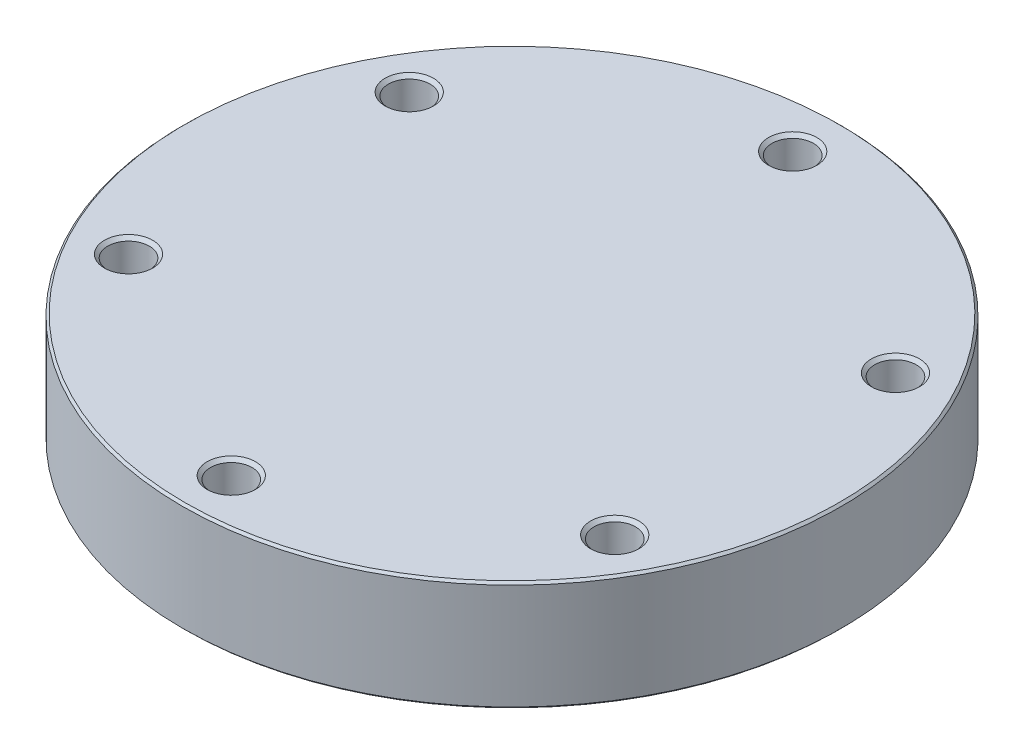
ISO-10303-21;
HEADER;
FILE_DESCRIPTION(('STEP AP214'),'2;1');
FILE_NAME('part.step','',(''),(''),'','','');
FILE_SCHEMA(('AUTOMOTIVE_DESIGN { 1 0 10303 214 1 1 1 1 }'));
ENDSEC;
DATA;
#1=APPLICATION_CONTEXT('core data for automotive mechanical design processes');
#2=APPLICATION_PROTOCOL_DEFINITION('international standard','automotive_design',2000,#1);
#3=PRODUCT_CONTEXT('',#1,'mechanical');
#4=PRODUCT('Part','Part','',(#3));
#5=PRODUCT_RELATED_PRODUCT_CATEGORY('part','',(#4));
#6=PRODUCT_DEFINITION_FORMATION('','',#4);
#7=PRODUCT_DEFINITION_CONTEXT('part definition',#1,'design');
#8=PRODUCT_DEFINITION('design','',#6,#7);
#9=PRODUCT_DEFINITION_SHAPE('','',#8);
#10=(LENGTH_UNIT() NAMED_UNIT(*) SI_UNIT(.MILLI.,.METRE.));
#11=(NAMED_UNIT(*) PLANE_ANGLE_UNIT() SI_UNIT($,.RADIAN.));
#12=(NAMED_UNIT(*) SI_UNIT($,.STERADIAN.) SOLID_ANGLE_UNIT());
#13=UNCERTAINTY_MEASURE_WITH_UNIT(LENGTH_MEASURE(1.E-05),#10,'distance_accuracy_value','');
#14=(GEOMETRIC_REPRESENTATION_CONTEXT(3) GLOBAL_UNCERTAINTY_ASSIGNED_CONTEXT((#13)) GLOBAL_UNIT_ASSIGNED_CONTEXT((#10,
#11,#12)) REPRESENTATION_CONTEXT('',''));
#15=CARTESIAN_POINT('',(0.,0.,0.));
#16=DIRECTION('',(0.,0.,1.));
#17=DIRECTION('',(1.,0.,0.));
#18=AXIS2_PLACEMENT_3D('',#15,#16,#17);
#19=CARTESIAN_POINT('',(0.,12.446,0.));
#20=DIRECTION('',(0.,-1.,0.));
#21=DIRECTION('',(0.,0.,-1.));
#22=AXIS2_PLACEMENT_3D('',#19,#20,#21);
#23=CYLINDRICAL_SURFACE('',#22,37.2745);
#24=CARTESIAN_POINT('',(0.,0.253999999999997,0.));
#25=DIRECTION('',(0.,1.,0.));
#26=DIRECTION('',(0.,0.,1.));
#27=AXIS2_PLACEMENT_3D('',#24,#25,#26);
#28=CIRCLE('',#27,37.2745);
#29=CARTESIAN_POINT('',(0.,0.253999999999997,37.2745));
#30=VERTEX_POINT('',#29);
#31=EDGE_CURVE('E79',#30,#30,#28,.T.);
#32=ORIENTED_EDGE('',*,*,#31,.T.);
#33=EDGE_LOOP('',(#32));
#34=FACE_BOUND('',#33,.T.);
#35=CARTESIAN_POINT('',(0.,12.192,0.));
#36=DIRECTION('',(0.,1.,0.));
#37=DIRECTION('',(0.,0.,1.));
#38=AXIS2_PLACEMENT_3D('',#35,#36,#37);
#39=CIRCLE('',#38,37.2745);
#40=CARTESIAN_POINT('',(0.,12.192,37.2745));
#41=VERTEX_POINT('',#40);
#42=EDGE_CURVE('E82',#41,#41,#39,.F.);
#43=ORIENTED_EDGE('',*,*,#42,.T.);
#44=EDGE_LOOP('',(#43));
#45=FACE_BOUND('',#44,.T.);
#46=ADVANCED_FACE('F40',(#34,#45),#23,.T.);
#47=CARTESIAN_POINT('',(0.,12.446,0.));
#48=DIRECTION('',(0.,1.,0.));
#49=DIRECTION('',(0.,0.,1.));
#50=AXIS2_PLACEMENT_3D('',#47,#48,#49);
#51=PLANE('',#50);
#52=CARTESIAN_POINT('',(0.,12.446,0.));
#53=DIRECTION('',(0.,1.,0.));
#54=DIRECTION('',(0.,0.,1.));
#55=AXIS2_PLACEMENT_3D('',#52,#53,#54);
#56=CIRCLE('',#55,37.0205);
#57=CARTESIAN_POINT('',(0.,12.446,37.0205));
#58=VERTEX_POINT('',#57);
#59=EDGE_CURVE('E73',#58,#58,#56,.T.);
#60=ORIENTED_EDGE('',*,*,#59,.T.);
#61=EDGE_LOOP('',(#60));
#62=FACE_BOUND('',#61,.T.);
#63=CARTESIAN_POINT('',(0.,12.446,-31.75));
#64=DIRECTION('',(0.,1.,0.));
#65=DIRECTION('',(0.,0.,1.));
#66=AXIS2_PLACEMENT_3D('',#63,#64,#65);
#67=CIRCLE('',#66,2.7305);
#68=CARTESIAN_POINT('',(0.,12.446,-29.0195));
#69=VERTEX_POINT('',#68);
#70=EDGE_CURVE('E151',#69,#69,#67,.T.);
#71=ORIENTED_EDGE('',*,*,#70,.F.);
#72=EDGE_LOOP('',(#71));
#73=FACE_BOUND('',#72,.T.);
#74=CARTESIAN_POINT('',(27.4963065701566,12.446,-15.8750000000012));
#75=DIRECTION('',(0.,1.,0.));
#76=DIRECTION('',(0.,0.,1.));
#77=AXIS2_PLACEMENT_3D('',#74,#75,#76);
#78=CIRCLE('',#77,2.7305);
#79=CARTESIAN_POINT('',(27.4963065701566,12.446,-13.1445000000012));
#80=VERTEX_POINT('',#79);
#81=EDGE_CURVE('E139',#80,#80,#78,.T.);
#82=ORIENTED_EDGE('',*,*,#81,.F.);
#83=EDGE_LOOP('',(#82));
#84=FACE_BOUND('',#83,.T.);
#85=CARTESIAN_POINT('',(27.496306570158,12.446,15.8749999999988));
#86=DIRECTION('',(0.,1.,0.));
#87=DIRECTION('',(0.,0.,1.));
#88=AXIS2_PLACEMENT_3D('',#85,#86,#87);
#89=CIRCLE('',#88,2.7305);
#90=CARTESIAN_POINT('',(27.496306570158,12.446,18.6054999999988));
#91=VERTEX_POINT('',#90);
#92=EDGE_CURVE('E127',#91,#91,#89,.T.);
#93=ORIENTED_EDGE('',*,*,#92,.F.);
#94=EDGE_LOOP('',(#93));
#95=FACE_BOUND('',#94,.T.);
#96=CARTESIAN_POINT('',(2.6955030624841E-12,12.446,31.75));
#97=DIRECTION('',(0.,1.,0.));
#98=DIRECTION('',(0.,0.,1.));
#99=AXIS2_PLACEMENT_3D('',#96,#97,#98);
#100=CIRCLE('',#99,2.7305);
#101=CARTESIAN_POINT('',(2.6955030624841E-12,12.446,34.4805));
#102=VERTEX_POINT('',#101);
#103=EDGE_CURVE('E115',#102,#102,#100,.T.);
#104=ORIENTED_EDGE('',*,*,#103,.F.);
#105=EDGE_LOOP('',(#104));
#106=FACE_BOUND('',#105,.T.);
#107=CARTESIAN_POINT('',(-27.4963065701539,12.446,15.8750000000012));
#108=DIRECTION('',(0.,1.,0.));
#109=DIRECTION('',(0.,0.,1.));
#110=AXIS2_PLACEMENT_3D('',#107,#108,#109);
#111=CIRCLE('',#110,2.7305);
#112=CARTESIAN_POINT('',(-27.4963065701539,12.446,18.6055000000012));
#113=VERTEX_POINT('',#112);
#114=EDGE_CURVE('E103',#113,#113,#111,.T.);
#115=ORIENTED_EDGE('',*,*,#114,.F.);
#116=EDGE_LOOP('',(#115));
#117=FACE_BOUND('',#116,.T.);
#118=CARTESIAN_POINT('',(-27.4963065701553,12.446,-15.8749999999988));
#119=DIRECTION('',(0.,1.,0.));
#120=DIRECTION('',(0.,0.,1.));
#121=AXIS2_PLACEMENT_3D('',#118,#119,#120);
#122=CIRCLE('',#121,2.7305);
#123=CARTESIAN_POINT('',(-27.4963065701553,12.446,-13.1444999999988));
#124=VERTEX_POINT('',#123);
#125=EDGE_CURVE('E91',#124,#124,#122,.T.);
#126=ORIENTED_EDGE('',*,*,#125,.F.);
#127=EDGE_LOOP('',(#126));
#128=FACE_BOUND('',#127,.T.);
#129=ADVANCED_FACE('F181',(#62,#73,#84,#95,#106,#117,#128),#51,.T.);
#130=CARTESIAN_POINT('',(0.,0.,0.));
#131=DIRECTION('',(0.,1.,0.));
#132=DIRECTION('',(0.,0.,1.));
#133=AXIS2_PLACEMENT_3D('',#130,#131,#132);
#134=PLANE('',#133);
#135=CARTESIAN_POINT('',(0.,0.,0.));
#136=DIRECTION('',(0.,1.,0.));
#137=DIRECTION('',(0.,0.,1.));
#138=AXIS2_PLACEMENT_3D('',#135,#136,#137);
#139=CIRCLE('',#138,27.8257);
#140=CARTESIAN_POINT('',(0.,0.,27.8257));
#141=VERTEX_POINT('',#140);
#142=EDGE_CURVE('E52',#141,#141,#139,.T.);
#143=ORIENTED_EDGE('',*,*,#142,.T.);
#144=EDGE_LOOP('',(#143));
#145=FACE_BOUND('',#144,.T.);
#146=CARTESIAN_POINT('',(0.,0.,0.));
#147=DIRECTION('',(0.,1.,0.));
#148=DIRECTION('',(0.,0.,1.));
#149=AXIS2_PLACEMENT_3D('',#146,#147,#148);
#150=CIRCLE('',#149,37.0205);
#151=CARTESIAN_POINT('',(0.,0.,37.0205));
#152=VERTEX_POINT('',#151);
#153=EDGE_CURVE('E76',#152,#152,#150,.F.);
#154=ORIENTED_EDGE('',*,*,#153,.T.);
#155=EDGE_LOOP('',(#154));
#156=FACE_BOUND('',#155,.T.);
#157=CARTESIAN_POINT('',(0.,0.,-31.75));
#158=DIRECTION('',(0.,1.,0.));
#159=DIRECTION('',(0.,0.,1.));
#160=AXIS2_PLACEMENT_3D('',#157,#158,#159);
#161=CIRCLE('',#160,2.7305);
#162=CARTESIAN_POINT('',(0.,0.,-29.0195));
#163=VERTEX_POINT('',#162);
#164=EDGE_CURVE('E154',#163,#163,#161,.T.);
#165=ORIENTED_EDGE('',*,*,#164,.T.);
#166=EDGE_LOOP('',(#165));
#167=FACE_BOUND('',#166,.T.);
#168=CARTESIAN_POINT('',(27.4963065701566,0.,-15.8750000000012));
#169=DIRECTION('',(0.,1.,0.));
#170=DIRECTION('',(0.,0.,1.));
#171=AXIS2_PLACEMENT_3D('',#168,#169,#170);
#172=CIRCLE('',#171,2.7305);
#173=CARTESIAN_POINT('',(27.4963065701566,0.,-13.1445000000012));
#174=VERTEX_POINT('',#173);
#175=EDGE_CURVE('E142',#174,#174,#172,.T.);
#176=ORIENTED_EDGE('',*,*,#175,.T.);
#177=EDGE_LOOP('',(#176));
#178=FACE_BOUND('',#177,.T.);
#179=CARTESIAN_POINT('',(27.496306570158,0.,15.8749999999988));
#180=DIRECTION('',(0.,1.,0.));
#181=DIRECTION('',(0.,0.,1.));
#182=AXIS2_PLACEMENT_3D('',#179,#180,#181);
#183=CIRCLE('',#182,2.7305);
#184=CARTESIAN_POINT('',(27.496306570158,0.,18.6054999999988));
#185=VERTEX_POINT('',#184);
#186=EDGE_CURVE('E130',#185,#185,#183,.T.);
#187=ORIENTED_EDGE('',*,*,#186,.T.);
#188=EDGE_LOOP('',(#187));
#189=FACE_BOUND('',#188,.T.);
#190=CARTESIAN_POINT('',(2.6955030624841E-12,0.,31.75));
#191=DIRECTION('',(0.,1.,0.));
#192=DIRECTION('',(0.,0.,1.));
#193=AXIS2_PLACEMENT_3D('',#190,#191,#192);
#194=CIRCLE('',#193,2.7305);
#195=CARTESIAN_POINT('',(2.6955030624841E-12,0.,34.4805));
#196=VERTEX_POINT('',#195);
#197=EDGE_CURVE('E118',#196,#196,#194,.T.);
#198=ORIENTED_EDGE('',*,*,#197,.T.);
#199=EDGE_LOOP('',(#198));
#200=FACE_BOUND('',#199,.T.);
#201=CARTESIAN_POINT('',(-27.4963065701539,0.,15.8750000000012));
#202=DIRECTION('',(0.,1.,0.));
#203=DIRECTION('',(0.,0.,1.));
#204=AXIS2_PLACEMENT_3D('',#201,#202,#203);
#205=CIRCLE('',#204,2.7305);
#206=CARTESIAN_POINT('',(-27.4963065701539,0.,18.6055000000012));
#207=VERTEX_POINT('',#206);
#208=EDGE_CURVE('E106',#207,#207,#205,.T.);
#209=ORIENTED_EDGE('',*,*,#208,.T.);
#210=EDGE_LOOP('',(#209));
#211=FACE_BOUND('',#210,.T.);
#212=CARTESIAN_POINT('',(-27.4963065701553,0.,-15.8749999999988));
#213=DIRECTION('',(0.,1.,0.));
#214=DIRECTION('',(0.,0.,1.));
#215=AXIS2_PLACEMENT_3D('',#212,#213,#214);
#216=CIRCLE('',#215,2.7305);
#217=CARTESIAN_POINT('',(-27.4963065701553,0.,-13.1444999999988));
#218=VERTEX_POINT('',#217);
#219=EDGE_CURVE('E94',#218,#218,#216,.T.);
#220=ORIENTED_EDGE('',*,*,#219,.T.);
#221=EDGE_LOOP('',(#220));
#222=FACE_BOUND('',#221,.T.);
#223=ADVANCED_FACE('F158',(#145,#156,#167,#178,#189,#200,#211,#222),#134,.F.);
#224=CARTESIAN_POINT('',(-27.4963065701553,0.380999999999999,-15.8749999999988));
#225=DIRECTION('',(0.,-1.,0.));
#226=DIRECTION('',(0.,0.,-1.));
#227=AXIS2_PLACEMENT_3D('',#224,#225,#226);
#228=CONICAL_SURFACE('',#227,2.3495,0.785398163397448);
#229=ORIENTED_EDGE('',*,*,#219,.F.);
#230=EDGE_LOOP('',(#229));
#231=FACE_BOUND('',#230,.T.);
#232=CARTESIAN_POINT('',(-27.4963065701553,0.380999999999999,-15.8749999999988));
#233=DIRECTION('',(0.,1.,0.));
#234=DIRECTION('',(0.,0.,1.));
#235=AXIS2_PLACEMENT_3D('',#232,#233,#234);
#236=CIRCLE('',#235,2.3495);
#237=CARTESIAN_POINT('',(-27.4963065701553,0.380999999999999,-13.5254999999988));
#238=VERTEX_POINT('',#237);
#239=EDGE_CURVE('E85',#238,#238,#236,.T.);
#240=ORIENTED_EDGE('',*,*,#239,.T.);
#241=EDGE_LOOP('',(#240));
#242=FACE_BOUND('',#241,.T.);
#243=ADVANCED_FACE('F209',(#231,#242),#228,.F.);
#244=CARTESIAN_POINT('',(-27.4963065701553,12.446,-15.8749999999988));
#245=DIRECTION('',(0.,1.,0.));
#246=DIRECTION('',(0.,0.,1.));
#247=AXIS2_PLACEMENT_3D('',#244,#245,#246);
#248=CYLINDRICAL_SURFACE('',#247,2.3495);
#249=ORIENTED_EDGE('',*,*,#239,.F.);
#250=EDGE_LOOP('',(#249));
#251=FACE_BOUND('',#250,.T.);
#252=CARTESIAN_POINT('',(-27.4963065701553,12.065,-15.8749999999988));
#253=DIRECTION('',(0.,1.,0.));
#254=DIRECTION('',(0.,0.,1.));
#255=AXIS2_PLACEMENT_3D('',#252,#253,#254);
#256=CIRCLE('',#255,2.3495);
#257=CARTESIAN_POINT('',(-27.4963065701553,12.065,-13.5254999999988));
#258=VERTEX_POINT('',#257);
#259=EDGE_CURVE('E88',#258,#258,#256,.T.);
#260=ORIENTED_EDGE('',*,*,#259,.T.);
#261=EDGE_LOOP('',(#260));
#262=FACE_BOUND('',#261,.T.);
#263=ADVANCED_FACE('F199',(#251,#262),#248,.F.);
#264=CARTESIAN_POINT('',(-27.4963065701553,12.446,-15.8749999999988));
#265=DIRECTION('',(0.,1.,0.));
#266=DIRECTION('',(0.,0.,1.));
#267=AXIS2_PLACEMENT_3D('',#264,#265,#266);
#268=CONICAL_SURFACE('',#267,2.7305,0.785398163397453);
#269=ORIENTED_EDGE('',*,*,#259,.F.);
#270=EDGE_LOOP('',(#269));
#271=FACE_BOUND('',#270,.T.);
#272=ORIENTED_EDGE('',*,*,#125,.T.);
#273=EDGE_LOOP('',(#272));
#274=FACE_BOUND('',#273,.T.);
#275=ADVANCED_FACE('F196',(#271,#274),#268,.F.);
#276=CARTESIAN_POINT('',(-27.4963065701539,0.380999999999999,15.8750000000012));
#277=DIRECTION('',(0.,-1.,0.));
#278=DIRECTION('',(0.,0.,-1.));
#279=AXIS2_PLACEMENT_3D('',#276,#277,#278);
#280=CONICAL_SURFACE('',#279,2.3495,0.785398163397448);
#281=ORIENTED_EDGE('',*,*,#208,.F.);
#282=EDGE_LOOP('',(#281));
#283=FACE_BOUND('',#282,.T.);
#284=CARTESIAN_POINT('',(-27.4963065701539,0.380999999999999,15.8750000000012));
#285=DIRECTION('',(0.,1.,0.));
#286=DIRECTION('',(0.,0.,1.));
#287=AXIS2_PLACEMENT_3D('',#284,#285,#286);
#288=CIRCLE('',#287,2.3495);
#289=CARTESIAN_POINT('',(-27.4963065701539,0.380999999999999,18.2245000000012));
#290=VERTEX_POINT('',#289);
#291=EDGE_CURVE('E97',#290,#290,#288,.T.);
#292=ORIENTED_EDGE('',*,*,#291,.T.);
#293=EDGE_LOOP('',(#292));
#294=FACE_BOUND('',#293,.T.);
#295=ADVANCED_FACE('F198',(#283,#294),#280,.F.);
#296=CARTESIAN_POINT('',(-27.4963065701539,12.446,15.8750000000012));
#297=DIRECTION('',(0.,1.,0.));
#298=DIRECTION('',(0.,0.,1.));
#299=AXIS2_PLACEMENT_3D('',#296,#297,#298);
#300=CYLINDRICAL_SURFACE('',#299,2.3495);
#301=ORIENTED_EDGE('',*,*,#291,.F.);
#302=EDGE_LOOP('',(#301));
#303=FACE_BOUND('',#302,.T.);
#304=CARTESIAN_POINT('',(-27.4963065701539,12.065,15.8750000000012));
#305=DIRECTION('',(0.,1.,0.));
#306=DIRECTION('',(0.,0.,1.));
#307=AXIS2_PLACEMENT_3D('',#304,#305,#306);
#308=CIRCLE('',#307,2.3495);
#309=CARTESIAN_POINT('',(-27.4963065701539,12.065,18.2245000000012));
#310=VERTEX_POINT('',#309);
#311=EDGE_CURVE('E100',#310,#310,#308,.T.);
#312=ORIENTED_EDGE('',*,*,#311,.T.);
#313=EDGE_LOOP('',(#312));
#314=FACE_BOUND('',#313,.T.);
#315=ADVANCED_FACE('F206',(#303,#314),#300,.F.);
#316=CARTESIAN_POINT('',(-27.4963065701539,12.446,15.8750000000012));
#317=DIRECTION('',(0.,1.,0.));
#318=DIRECTION('',(0.,0.,1.));
#319=AXIS2_PLACEMENT_3D('',#316,#317,#318);
#320=CONICAL_SURFACE('',#319,2.7305,0.785398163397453);
#321=ORIENTED_EDGE('',*,*,#311,.F.);
#322=EDGE_LOOP('',(#321));
#323=FACE_BOUND('',#322,.T.);
#324=ORIENTED_EDGE('',*,*,#114,.T.);
#325=EDGE_LOOP('',(#324));
#326=FACE_BOUND('',#325,.T.);
#327=ADVANCED_FACE('F313',(#323,#326),#320,.F.);
#328=CARTESIAN_POINT('',(2.6955030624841E-12,0.380999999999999,31.75));
#329=DIRECTION('',(0.,-1.,0.));
#330=DIRECTION('',(0.,0.,-1.));
#331=AXIS2_PLACEMENT_3D('',#328,#329,#330);
#332=CONICAL_SURFACE('',#331,2.3495,0.785398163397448);
#333=ORIENTED_EDGE('',*,*,#197,.F.);
#334=EDGE_LOOP('',(#333));
#335=FACE_BOUND('',#334,.T.);
#336=CARTESIAN_POINT('',(2.6955030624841E-12,0.380999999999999,31.75));
#337=DIRECTION('',(0.,1.,0.));
#338=DIRECTION('',(0.,0.,1.));
#339=AXIS2_PLACEMENT_3D('',#336,#337,#338);
#340=CIRCLE('',#339,2.3495);
#341=CARTESIAN_POINT('',(2.6955030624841E-12,0.380999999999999,34.0995));
#342=VERTEX_POINT('',#341);
#343=EDGE_CURVE('E109',#342,#342,#340,.T.);
#344=ORIENTED_EDGE('',*,*,#343,.T.);
#345=EDGE_LOOP('',(#344));
#346=FACE_BOUND('',#345,.T.);
#347=ADVANCED_FACE('F309',(#335,#346),#332,.F.);
#348=CARTESIAN_POINT('',(2.6955030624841E-12,12.446,31.75));
#349=DIRECTION('',(0.,1.,0.));
#350=DIRECTION('',(0.,0.,1.));
#351=AXIS2_PLACEMENT_3D('',#348,#349,#350);
#352=CYLINDRICAL_SURFACE('',#351,2.3495);
#353=ORIENTED_EDGE('',*,*,#343,.F.);
#354=EDGE_LOOP('',(#353));
#355=FACE_BOUND('',#354,.T.);
#356=CARTESIAN_POINT('',(2.6955030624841E-12,12.065,31.75));
#357=DIRECTION('',(0.,1.,0.));
#358=DIRECTION('',(0.,0.,1.));
#359=AXIS2_PLACEMENT_3D('',#356,#357,#358);
#360=CIRCLE('',#359,2.3495);
#361=CARTESIAN_POINT('',(2.6955030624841E-12,12.065,34.0995));
#362=VERTEX_POINT('',#361);
#363=EDGE_CURVE('E112',#362,#362,#360,.T.);
#364=ORIENTED_EDGE('',*,*,#363,.T.);
#365=EDGE_LOOP('',(#364));
#366=FACE_BOUND('',#365,.T.);
#367=ADVANCED_FACE('F305',(#355,#366),#352,.F.);
#368=CARTESIAN_POINT('',(2.6955030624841E-12,12.446,31.75));
#369=DIRECTION('',(0.,1.,0.));
#370=DIRECTION('',(0.,0.,1.));
#371=AXIS2_PLACEMENT_3D('',#368,#369,#370);
#372=CONICAL_SURFACE('',#371,2.7305,0.785398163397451);
#373=ORIENTED_EDGE('',*,*,#363,.F.);
#374=EDGE_LOOP('',(#373));
#375=FACE_BOUND('',#374,.T.);
#376=ORIENTED_EDGE('',*,*,#103,.T.);
#377=EDGE_LOOP('',(#376));
#378=FACE_BOUND('',#377,.T.);
#379=ADVANCED_FACE('F301',(#375,#378),#372,.F.);
#380=CARTESIAN_POINT('',(27.496306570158,0.380999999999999,15.8749999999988));
#381=DIRECTION('',(0.,-1.,0.));
#382=DIRECTION('',(0.,0.,-1.));
#383=AXIS2_PLACEMENT_3D('',#380,#381,#382);
#384=CONICAL_SURFACE('',#383,2.3495,0.785398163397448);
#385=ORIENTED_EDGE('',*,*,#186,.F.);
#386=EDGE_LOOP('',(#385));
#387=FACE_BOUND('',#386,.T.);
#388=CARTESIAN_POINT('',(27.496306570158,0.380999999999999,15.8749999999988));
#389=DIRECTION('',(0.,1.,0.));
#390=DIRECTION('',(0.,0.,1.));
#391=AXIS2_PLACEMENT_3D('',#388,#389,#390);
#392=CIRCLE('',#391,2.3495);
#393=CARTESIAN_POINT('',(27.496306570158,0.380999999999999,18.2244999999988));
#394=VERTEX_POINT('',#393);
#395=EDGE_CURVE('E121',#394,#394,#392,.T.);
#396=ORIENTED_EDGE('',*,*,#395,.T.);
#397=EDGE_LOOP('',(#396));
#398=FACE_BOUND('',#397,.T.);
#399=ADVANCED_FACE('F297',(#387,#398),#384,.F.);
#400=CARTESIAN_POINT('',(27.496306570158,12.446,15.8749999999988));
#401=DIRECTION('',(0.,1.,0.));
#402=DIRECTION('',(0.,0.,1.));
#403=AXIS2_PLACEMENT_3D('',#400,#401,#402);
#404=CYLINDRICAL_SURFACE('',#403,2.3495);
#405=ORIENTED_EDGE('',*,*,#395,.F.);
#406=EDGE_LOOP('',(#405));
#407=FACE_BOUND('',#406,.T.);
#408=CARTESIAN_POINT('',(27.496306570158,12.065,15.8749999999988));
#409=DIRECTION('',(0.,1.,0.));
#410=DIRECTION('',(0.,0.,1.));
#411=AXIS2_PLACEMENT_3D('',#408,#409,#410);
#412=CIRCLE('',#411,2.3495);
#413=CARTESIAN_POINT('',(27.496306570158,12.065,18.2244999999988));
#414=VERTEX_POINT('',#413);
#415=EDGE_CURVE('E124',#414,#414,#412,.T.);
#416=ORIENTED_EDGE('',*,*,#415,.T.);
#417=EDGE_LOOP('',(#416));
#418=FACE_BOUND('',#417,.T.);
#419=ADVANCED_FACE('F293',(#407,#418),#404,.F.);
#420=CARTESIAN_POINT('',(27.496306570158,12.446,15.8749999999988));
#421=DIRECTION('',(0.,1.,0.));
#422=DIRECTION('',(0.,0.,1.));
#423=AXIS2_PLACEMENT_3D('',#420,#421,#422);
#424=CONICAL_SURFACE('',#423,2.7305,0.785398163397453);
#425=ORIENTED_EDGE('',*,*,#415,.F.);
#426=EDGE_LOOP('',(#425));
#427=FACE_BOUND('',#426,.T.);
#428=ORIENTED_EDGE('',*,*,#92,.T.);
#429=EDGE_LOOP('',(#428));
#430=FACE_BOUND('',#429,.T.);
#431=ADVANCED_FACE('F289',(#427,#430),#424,.F.);
#432=CARTESIAN_POINT('',(27.4963065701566,0.380999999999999,-15.8750000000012));
#433=DIRECTION('',(0.,-1.,0.));
#434=DIRECTION('',(0.,0.,-1.));
#435=AXIS2_PLACEMENT_3D('',#432,#433,#434);
#436=CONICAL_SURFACE('',#435,2.3495,0.785398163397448);
#437=ORIENTED_EDGE('',*,*,#175,.F.);
#438=EDGE_LOOP('',(#437));
#439=FACE_BOUND('',#438,.T.);
#440=CARTESIAN_POINT('',(27.4963065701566,0.380999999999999,-15.8750000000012));
#441=DIRECTION('',(0.,1.,0.));
#442=DIRECTION('',(0.,0.,1.));
#443=AXIS2_PLACEMENT_3D('',#440,#441,#442);
#444=CIRCLE('',#443,2.3495);
#445=CARTESIAN_POINT('',(27.4963065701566,0.380999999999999,-13.5255000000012));
#446=VERTEX_POINT('',#445);
#447=EDGE_CURVE('E133',#446,#446,#444,.T.);
#448=ORIENTED_EDGE('',*,*,#447,.T.);
#449=EDGE_LOOP('',(#448));
#450=FACE_BOUND('',#449,.T.);
#451=ADVANCED_FACE('F285',(#439,#450),#436,.F.);
#452=CARTESIAN_POINT('',(27.4963065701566,12.446,-15.8750000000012));
#453=DIRECTION('',(0.,1.,0.));
#454=DIRECTION('',(0.,0.,1.));
#455=AXIS2_PLACEMENT_3D('',#452,#453,#454);
#456=CYLINDRICAL_SURFACE('',#455,2.3495);
#457=ORIENTED_EDGE('',*,*,#447,.F.);
#458=EDGE_LOOP('',(#457));
#459=FACE_BOUND('',#458,.T.);
#460=CARTESIAN_POINT('',(27.4963065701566,12.065,-15.8750000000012));
#461=DIRECTION('',(0.,1.,0.));
#462=DIRECTION('',(0.,0.,1.));
#463=AXIS2_PLACEMENT_3D('',#460,#461,#462);
#464=CIRCLE('',#463,2.3495);
#465=CARTESIAN_POINT('',(27.4963065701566,12.065,-13.5255000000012));
#466=VERTEX_POINT('',#465);
#467=EDGE_CURVE('E136',#466,#466,#464,.T.);
#468=ORIENTED_EDGE('',*,*,#467,.T.);
#469=EDGE_LOOP('',(#468));
#470=FACE_BOUND('',#469,.T.);
#471=ADVANCED_FACE('F281',(#459,#470),#456,.F.);
#472=CARTESIAN_POINT('',(27.4963065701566,12.446,-15.8750000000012));
#473=DIRECTION('',(0.,1.,0.));
#474=DIRECTION('',(0.,0.,1.));
#475=AXIS2_PLACEMENT_3D('',#472,#473,#474);
#476=CONICAL_SURFACE('',#475,2.7305,0.785398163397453);
#477=ORIENTED_EDGE('',*,*,#467,.F.);
#478=EDGE_LOOP('',(#477));
#479=FACE_BOUND('',#478,.T.);
#480=ORIENTED_EDGE('',*,*,#81,.T.);
#481=EDGE_LOOP('',(#480));
#482=FACE_BOUND('',#481,.T.);
#483=ADVANCED_FACE('F165',(#479,#482),#476,.F.);
#484=CARTESIAN_POINT('',(0.,0.380999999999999,-31.75));
#485=DIRECTION('',(0.,-1.,0.));
#486=DIRECTION('',(0.,0.,-1.));
#487=AXIS2_PLACEMENT_3D('',#484,#485,#486);
#488=CONICAL_SURFACE('',#487,2.3495,0.785398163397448);
#489=ORIENTED_EDGE('',*,*,#164,.F.);
#490=EDGE_LOOP('',(#489));
#491=FACE_BOUND('',#490,.T.);
#492=CARTESIAN_POINT('',(0.,0.380999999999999,-31.75));
#493=DIRECTION('',(0.,1.,0.));
#494=DIRECTION('',(0.,0.,1.));
#495=AXIS2_PLACEMENT_3D('',#492,#493,#494);
#496=CIRCLE('',#495,2.3495);
#497=CARTESIAN_POINT('',(0.,0.380999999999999,-29.4005));
#498=VERTEX_POINT('',#497);
#499=EDGE_CURVE('E145',#498,#498,#496,.T.);
#500=ORIENTED_EDGE('',*,*,#499,.T.);
#501=EDGE_LOOP('',(#500));
#502=FACE_BOUND('',#501,.T.);
#503=ADVANCED_FACE('F161',(#491,#502),#488,.F.);
#504=CARTESIAN_POINT('',(0.,12.446,-31.75));
#505=DIRECTION('',(0.,1.,0.));
#506=DIRECTION('',(0.,0.,1.));
#507=AXIS2_PLACEMENT_3D('',#504,#505,#506);
#508=CYLINDRICAL_SURFACE('',#507,2.3495);
#509=ORIENTED_EDGE('',*,*,#499,.F.);
#510=EDGE_LOOP('',(#509));
#511=FACE_BOUND('',#510,.T.);
#512=CARTESIAN_POINT('',(0.,12.065,-31.75));
#513=DIRECTION('',(0.,1.,0.));
#514=DIRECTION('',(0.,0.,1.));
#515=AXIS2_PLACEMENT_3D('',#512,#513,#514);
#516=CIRCLE('',#515,2.3495);
#517=CARTESIAN_POINT('',(0.,12.065,-29.4005));
#518=VERTEX_POINT('',#517);
#519=EDGE_CURVE('E148',#518,#518,#516,.T.);
#520=ORIENTED_EDGE('',*,*,#519,.T.);
#521=EDGE_LOOP('',(#520));
#522=FACE_BOUND('',#521,.T.);
#523=ADVANCED_FACE('F164',(#511,#522),#508,.F.);
#524=CARTESIAN_POINT('',(0.,12.446,-31.75));
#525=DIRECTION('',(0.,1.,0.));
#526=DIRECTION('',(0.,0.,1.));
#527=AXIS2_PLACEMENT_3D('',#524,#525,#526);
#528=CONICAL_SURFACE('',#527,2.7305,0.785398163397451);
#529=ORIENTED_EDGE('',*,*,#519,.F.);
#530=EDGE_LOOP('',(#529));
#531=FACE_BOUND('',#530,.T.);
#532=ORIENTED_EDGE('',*,*,#70,.T.);
#533=EDGE_LOOP('',(#532));
#534=FACE_BOUND('',#533,.T.);
#535=ADVANCED_FACE('F171',(#531,#534),#528,.F.);
#536=CARTESIAN_POINT('',(0.,0.253999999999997,0.));
#537=DIRECTION('',(0.,1.,0.));
#538=DIRECTION('',(0.,0.,1.));
#539=AXIS2_PLACEMENT_3D('',#536,#537,#538);
#540=CONICAL_SURFACE('',#539,37.2745,0.785398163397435);
#541=ORIENTED_EDGE('',*,*,#153,.F.);
#542=EDGE_LOOP('',(#541));
#543=FACE_BOUND('',#542,.T.);
#544=ORIENTED_EDGE('',*,*,#31,.F.);
#545=EDGE_LOOP('',(#544));
#546=FACE_BOUND('',#545,.T.);
#547=ADVANCED_FACE('F177',(#543,#546),#540,.T.);
#548=CARTESIAN_POINT('',(0.,12.446,0.));
#549=DIRECTION('',(0.,-1.,0.));
#550=DIRECTION('',(0.,0.,-1.));
#551=AXIS2_PLACEMENT_3D('',#548,#549,#550);
#552=CONICAL_SURFACE('',#551,37.0205,0.785398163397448);
#553=ORIENTED_EDGE('',*,*,#42,.F.);
#554=EDGE_LOOP('',(#553));
#555=FACE_BOUND('',#554,.T.);
#556=ORIENTED_EDGE('',*,*,#59,.F.);
#557=EDGE_LOOP('',(#556));
#558=FACE_BOUND('',#557,.T.);
#559=ADVANCED_FACE('F227',(#555,#558),#552,.T.);
#560=CARTESIAN_POINT('',(0.,2.6416,0.));
#561=DIRECTION('',(0.,-1.,0.));
#562=DIRECTION('',(0.,0.,-1.));
#563=AXIS2_PLACEMENT_3D('',#560,#561,#562);
#564=CYLINDRICAL_SURFACE('',#563,27.6987);
#565=CARTESIAN_POINT('',(0.,0.126999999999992,0.));
#566=DIRECTION('',(0.,1.,0.));
#567=DIRECTION('',(0.,0.,1.));
#568=AXIS2_PLACEMENT_3D('',#565,#566,#567);
#569=CIRCLE('',#568,27.6987);
#570=CARTESIAN_POINT('',(0.,0.126999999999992,27.6987));
#571=VERTEX_POINT('',#570);
#572=EDGE_CURVE('E56',#571,#571,#569,.F.);
#573=ORIENTED_EDGE('',*,*,#572,.T.);
#574=EDGE_LOOP('',(#573));
#575=FACE_BOUND('',#574,.T.);
#576=CARTESIAN_POINT('',(0.,2.2606,0.));
#577=DIRECTION('',(0.,-1.,0.));
#578=DIRECTION('',(0.,0.,-1.));
#579=AXIS2_PLACEMENT_3D('',#576,#577,#578);
#580=CIRCLE('',#579,27.6987);
#581=CARTESIAN_POINT('',(0.,2.2606,-27.6987));
#582=VERTEX_POINT('',#581);
#583=EDGE_CURVE('E64',#582,#582,#580,.F.);
#584=ORIENTED_EDGE('',*,*,#583,.T.);
#585=EDGE_LOOP('',(#584));
#586=FACE_BOUND('',#585,.T.);
#587=ADVANCED_FACE('F234',(#575,#586),#564,.F.);
#588=CARTESIAN_POINT('',(0.,2.6416,0.));
#589=DIRECTION('',(0.,-1.,0.));
#590=DIRECTION('',(0.,0.,-1.));
#591=AXIS2_PLACEMENT_3D('',#588,#589,#590);
#592=PLANE('',#591);
#593=CARTESIAN_POINT('',(0.,2.6416,0.));
#594=DIRECTION('',(0.,-1.,0.));
#595=DIRECTION('',(0.,0.,-1.));
#596=AXIS2_PLACEMENT_3D('',#593,#594,#595);
#597=CIRCLE('',#596,27.3177);
#598=CARTESIAN_POINT('',(0.,2.6416,-27.3177));
#599=VERTEX_POINT('',#598);
#600=EDGE_CURVE('E67',#599,#599,#597,.T.);
#601=ORIENTED_EDGE('',*,*,#600,.T.);
#602=EDGE_LOOP('',(#601));
#603=FACE_BOUND('',#602,.T.);
#604=CARTESIAN_POINT('',(0.,2.6416,0.));
#605=DIRECTION('',(0.,-1.,0.));
#606=DIRECTION('',(0.,0.,-1.));
#607=AXIS2_PLACEMENT_3D('',#604,#605,#606);
#608=CIRCLE('',#607,23.9903);
#609=CARTESIAN_POINT('',(0.,2.6416,-23.9903));
#610=VERTEX_POINT('',#609);
#611=EDGE_CURVE('E70',#610,#610,#608,.F.);
#612=ORIENTED_EDGE('',*,*,#611,.T.);
#613=EDGE_LOOP('',(#612));
#614=FACE_BOUND('',#613,.T.);
#615=ADVANCED_FACE('F259',(#603,#614),#592,.T.);
#616=CARTESIAN_POINT('',(0.,2.6416,0.));
#617=DIRECTION('',(0.,-1.,0.));
#618=DIRECTION('',(0.,0.,-1.));
#619=AXIS2_PLACEMENT_3D('',#616,#617,#618);
#620=CYLINDRICAL_SURFACE('',#619,23.6093);
#621=CARTESIAN_POINT('',(0.,0.126999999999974,0.));
#622=DIRECTION('',(0.,1.,0.));
#623=DIRECTION('',(0.,0.,1.));
#624=AXIS2_PLACEMENT_3D('',#621,#622,#623);
#625=CIRCLE('',#624,23.6093);
#626=CARTESIAN_POINT('',(0.,0.126999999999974,23.6093));
#627=VERTEX_POINT('',#626);
#628=EDGE_CURVE('E10',#627,#627,#625,.T.);
#629=ORIENTED_EDGE('',*,*,#628,.T.);
#630=EDGE_LOOP('',(#629));
#631=FACE_BOUND('',#630,.T.);
#632=CARTESIAN_POINT('',(0.,2.2606,0.));
#633=DIRECTION('',(0.,-1.,0.));
#634=DIRECTION('',(0.,0.,-1.));
#635=AXIS2_PLACEMENT_3D('',#632,#633,#634);
#636=CIRCLE('',#635,23.6093);
#637=CARTESIAN_POINT('',(0.,2.2606,-23.6093));
#638=VERTEX_POINT('',#637);
#639=EDGE_CURVE('E61',#638,#638,#636,.T.);
#640=ORIENTED_EDGE('',*,*,#639,.T.);
#641=EDGE_LOOP('',(#640));
#642=FACE_BOUND('',#641,.T.);
#643=ADVANCED_FACE('F267',(#631,#642),#620,.T.);
#644=CARTESIAN_POINT('',(0.,0.,0.));
#645=DIRECTION('',(0.,1.,0.));
#646=DIRECTION('',(0.,0.,1.));
#647=AXIS2_PLACEMENT_3D('',#644,#645,#646);
#648=CIRCLE('',#647,23.4823);
#649=CARTESIAN_POINT('',(0.,0.,23.4823));
#650=VERTEX_POINT('',#649);
#651=EDGE_CURVE('E48',#650,#650,#648,.F.);
#652=ORIENTED_EDGE('',*,*,#651,.T.);
#653=EDGE_LOOP('',(#652));
#654=FACE_BOUND('',#653,.T.);
#655=ADVANCED_FACE('F240',(#654),#134,.F.);
#656=CARTESIAN_POINT('',(0.,2.2606,0.));
#657=DIRECTION('',(0.,-1.,0.));
#658=DIRECTION('',(0.,0.,-1.));
#659=AXIS2_PLACEMENT_3D('',#656,#657,#658);
#660=TOROIDAL_SURFACE('',#659,27.3177,0.381);
#661=ORIENTED_EDGE('',*,*,#583,.F.);
#662=EDGE_LOOP('',(#661));
#663=FACE_BOUND('',#662,.T.);
#664=ORIENTED_EDGE('',*,*,#600,.F.);
#665=EDGE_LOOP('',(#664));
#666=FACE_BOUND('',#665,.T.);
#667=ADVANCED_FACE('F236',(#663,#666),#660,.F.);
#668=CARTESIAN_POINT('',(0.,2.2606,0.));
#669=DIRECTION('',(0.,-1.,0.));
#670=DIRECTION('',(0.,0.,-1.));
#671=AXIS2_PLACEMENT_3D('',#668,#669,#670);
#672=TOROIDAL_SURFACE('',#671,23.9903,0.381);
#673=ORIENTED_EDGE('',*,*,#611,.F.);
#674=EDGE_LOOP('',(#673));
#675=FACE_BOUND('',#674,.T.);
#676=ORIENTED_EDGE('',*,*,#639,.F.);
#677=EDGE_LOOP('',(#676));
#678=FACE_BOUND('',#677,.T.);
#679=ADVANCED_FACE('F239',(#675,#678),#672,.F.);
#680=CARTESIAN_POINT('',(0.,0.126999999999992,0.));
#681=DIRECTION('',(0.,-1.,0.));
#682=DIRECTION('',(0.,0.,-1.));
#683=AXIS2_PLACEMENT_3D('',#680,#681,#682);
#684=CONICAL_SURFACE('',#683,27.6987,0.785398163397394);
#685=ORIENTED_EDGE('',*,*,#142,.F.);
#686=EDGE_LOOP('',(#685));
#687=FACE_BOUND('',#686,.T.);
#688=ORIENTED_EDGE('',*,*,#572,.F.);
#689=EDGE_LOOP('',(#688));
#690=FACE_BOUND('',#689,.T.);
#691=ADVANCED_FACE('F243',(#687,#690),#684,.F.);
#692=CARTESIAN_POINT('',(0.,0.,0.));
#693=DIRECTION('',(0.,1.,0.));
#694=DIRECTION('',(0.,0.,1.));
#695=AXIS2_PLACEMENT_3D('',#692,#693,#694);
#696=CONICAL_SURFACE('',#695,23.4823,0.78539816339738);
#697=ORIENTED_EDGE('',*,*,#628,.F.);
#698=EDGE_LOOP('',(#697));
#699=FACE_BOUND('',#698,.T.);
#700=ORIENTED_EDGE('',*,*,#651,.F.);
#701=EDGE_LOOP('',(#700));
#702=FACE_BOUND('',#701,.T.);
#703=ADVANCED_FACE('F43',(#699,#702),#696,.T.);
#704=CLOSED_SHELL('',(#46,#129,#223,#243,#263,#275,#295,#315,#327,#347,#367,#379,#399,#419,#431,
#451,#471,#483,#503,#523,#535,#547,#559,#587,#615,#643,#655,#667,#679,#691,#703));
#705=MANIFOLD_SOLID_BREP('B2',#704);
#706=ADVANCED_BREP_SHAPE_REPRESENTATION('',(#18,#705),#14);
#707=SHAPE_DEFINITION_REPRESENTATION(#9,#706);
ENDSEC;
END-ISO-10303-21;
